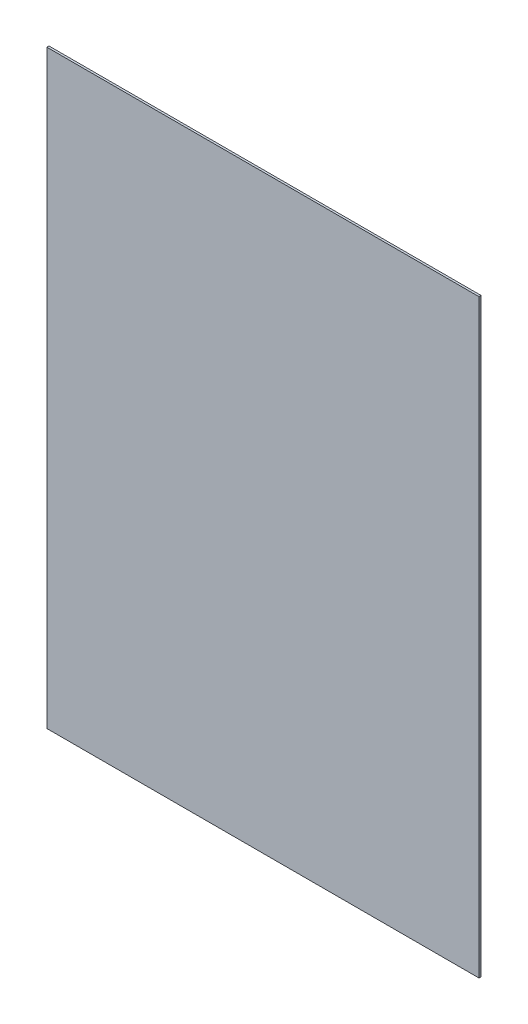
ISO-10303-21;
HEADER;
FILE_DESCRIPTION(('STEP AP214'),'2;1');
FILE_NAME('part.step','',(''),(''),'','','');
FILE_SCHEMA(('AUTOMOTIVE_DESIGN { 1 0 10303 214 1 1 1 1 }'));
ENDSEC;
DATA;
#1=APPLICATION_CONTEXT('core data for automotive mechanical design processes');
#2=APPLICATION_PROTOCOL_DEFINITION('international standard','automotive_design',2000,#1);
#3=PRODUCT_CONTEXT('',#1,'mechanical');
#4=PRODUCT('Part','Part','',(#3));
#5=PRODUCT_RELATED_PRODUCT_CATEGORY('part','',(#4));
#6=PRODUCT_DEFINITION_FORMATION('','',#4);
#7=PRODUCT_DEFINITION_CONTEXT('part definition',#1,'design');
#8=PRODUCT_DEFINITION('design','',#6,#7);
#9=PRODUCT_DEFINITION_SHAPE('','',#8);
#10=(LENGTH_UNIT() NAMED_UNIT(*) SI_UNIT(.MILLI.,.METRE.));
#11=(NAMED_UNIT(*) PLANE_ANGLE_UNIT() SI_UNIT($,.RADIAN.));
#12=(NAMED_UNIT(*) SI_UNIT($,.STERADIAN.) SOLID_ANGLE_UNIT());
#13=UNCERTAINTY_MEASURE_WITH_UNIT(LENGTH_MEASURE(1.E-05),#10,'distance_accuracy_value','');
#14=(GEOMETRIC_REPRESENTATION_CONTEXT(3) GLOBAL_UNCERTAINTY_ASSIGNED_CONTEXT((#13)) GLOBAL_UNIT_ASSIGNED_CONTEXT((#10,
#11,#12)) REPRESENTATION_CONTEXT('',''));
#15=CARTESIAN_POINT('',(0.,0.,0.));
#16=DIRECTION('',(0.,0.,1.));
#17=DIRECTION('',(1.,0.,0.));
#18=AXIS2_PLACEMENT_3D('',#15,#16,#17);
#19=CARTESIAN_POINT('',(410.,-560.,4.));
#20=DIRECTION('',(-1.,0.,0.));
#21=DIRECTION('',(0.,0.,1.));
#22=AXIS2_PLACEMENT_3D('',#19,#20,#21);
#23=PLANE('',#22);
#24=DIRECTION('',(0.,1.,0.));
#25=VECTOR('',#24,1.);
#26=CARTESIAN_POINT('',(410.,-560.,0.));
#27=LINE('',#26,#25);
#28=CARTESIAN_POINT('',(410.,-560.,0.));
#29=VERTEX_POINT('',#28);
#30=CARTESIAN_POINT('',(410.,560.,0.));
#31=VERTEX_POINT('',#30);
#32=EDGE_CURVE('E100',#29,#31,#27,.T.);
#33=ORIENTED_EDGE('',*,*,#32,.T.);
#34=DIRECTION('',(0.,0.,-1.));
#35=VECTOR('',#34,1.);
#36=CARTESIAN_POINT('',(410.,560.,4.));
#37=LINE('',#36,#35);
#38=CARTESIAN_POINT('',(410.,560.,4.));
#39=VERTEX_POINT('',#38);
#40=EDGE_CURVE('E11',#39,#31,#37,.T.);
#41=ORIENTED_EDGE('',*,*,#40,.F.);
#42=DIRECTION('',(0.,1.,0.));
#43=VECTOR('',#42,1.);
#44=CARTESIAN_POINT('',(410.,-560.,4.));
#45=LINE('',#44,#43);
#46=CARTESIAN_POINT('',(410.,-560.,4.));
#47=VERTEX_POINT('',#46);
#48=EDGE_CURVE('E88',#47,#39,#45,.T.);
#49=ORIENTED_EDGE('',*,*,#48,.F.);
#50=DIRECTION('',(0.,0.,-1.));
#51=VECTOR('',#50,1.);
#52=CARTESIAN_POINT('',(410.,-560.,4.));
#53=LINE('',#52,#51);
#54=EDGE_CURVE('E96',#47,#29,#53,.T.);
#55=ORIENTED_EDGE('',*,*,#54,.T.);
#56=EDGE_LOOP('',(#33,#41,#49,#55));
#57=FACE_BOUND('',#56,.T.);
#58=ADVANCED_FACE('F37',(#57),#23,.F.);
#59=CARTESIAN_POINT('',(-410.,560.,4.));
#60=DIRECTION('',(0.,-1.,0.));
#61=DIRECTION('',(0.,0.,-1.));
#62=AXIS2_PLACEMENT_3D('',#59,#60,#61);
#63=PLANE('',#62);
#64=DIRECTION('',(-1.,0.,0.));
#65=VECTOR('',#64,1.);
#66=CARTESIAN_POINT('',(-410.,560.,0.));
#67=LINE('',#66,#65);
#68=CARTESIAN_POINT('',(-410.,560.,0.));
#69=VERTEX_POINT('',#68);
#70=EDGE_CURVE('E92',#31,#69,#67,.T.);
#71=ORIENTED_EDGE('',*,*,#70,.T.);
#72=DIRECTION('',(0.,0.,-1.));
#73=VECTOR('',#72,1.);
#74=CARTESIAN_POINT('',(-410.,560.,4.));
#75=LINE('',#74,#73);
#76=CARTESIAN_POINT('',(-410.,560.,4.));
#77=VERTEX_POINT('',#76);
#78=EDGE_CURVE('E45',#77,#69,#75,.T.);
#79=ORIENTED_EDGE('',*,*,#78,.F.);
#80=DIRECTION('',(-1.,0.,0.));
#81=VECTOR('',#80,1.);
#82=CARTESIAN_POINT('',(-410.,560.,4.));
#83=LINE('',#82,#81);
#84=EDGE_CURVE('E83',#39,#77,#83,.T.);
#85=ORIENTED_EDGE('',*,*,#84,.F.);
#86=ORIENTED_EDGE('',*,*,#40,.T.);
#87=EDGE_LOOP('',(#71,#79,#85,#86));
#88=FACE_BOUND('',#87,.T.);
#89=ADVANCED_FACE('F91',(#88),#63,.F.);
#90=CARTESIAN_POINT('',(-410.,-560.,4.));
#91=DIRECTION('',(1.,0.,0.));
#92=DIRECTION('',(0.,0.,-1.));
#93=AXIS2_PLACEMENT_3D('',#90,#91,#92);
#94=PLANE('',#93);
#95=DIRECTION('',(0.,-1.,0.));
#96=VECTOR('',#95,1.);
#97=CARTESIAN_POINT('',(-410.,-560.,0.));
#98=LINE('',#97,#96);
#99=CARTESIAN_POINT('',(-410.,-560.,0.));
#100=VERTEX_POINT('',#99);
#101=EDGE_CURVE('E70',#69,#100,#98,.T.);
#102=ORIENTED_EDGE('',*,*,#101,.T.);
#103=DIRECTION('',(0.,0.,-1.));
#104=VECTOR('',#103,1.);
#105=CARTESIAN_POINT('',(-410.,-560.,4.));
#106=LINE('',#105,#104);
#107=CARTESIAN_POINT('',(-410.,-560.,4.));
#108=VERTEX_POINT('',#107);
#109=EDGE_CURVE('E93',#108,#100,#106,.T.);
#110=ORIENTED_EDGE('',*,*,#109,.F.);
#111=DIRECTION('',(0.,-1.,0.));
#112=VECTOR('',#111,1.);
#113=CARTESIAN_POINT('',(-410.,-560.,4.));
#114=LINE('',#113,#112);
#115=EDGE_CURVE('E86',#77,#108,#114,.T.);
#116=ORIENTED_EDGE('',*,*,#115,.F.);
#117=ORIENTED_EDGE('',*,*,#78,.T.);
#118=EDGE_LOOP('',(#102,#110,#116,#117));
#119=FACE_BOUND('',#118,.T.);
#120=ADVANCED_FACE('F94',(#119),#94,.F.);
#121=CARTESIAN_POINT('',(-410.,-560.,4.));
#122=DIRECTION('',(0.,1.,0.));
#123=DIRECTION('',(0.,0.,1.));
#124=AXIS2_PLACEMENT_3D('',#121,#122,#123);
#125=PLANE('',#124);
#126=DIRECTION('',(1.,0.,0.));
#127=VECTOR('',#126,1.);
#128=CARTESIAN_POINT('',(-410.,-560.,0.));
#129=LINE('',#128,#127);
#130=EDGE_CURVE('E76',#100,#29,#129,.T.);
#131=ORIENTED_EDGE('',*,*,#130,.T.);
#132=ORIENTED_EDGE('',*,*,#54,.F.);
#133=DIRECTION('',(1.,0.,0.));
#134=VECTOR('',#133,1.);
#135=CARTESIAN_POINT('',(-410.,-560.,4.));
#136=LINE('',#135,#134);
#137=EDGE_CURVE('E53',#108,#47,#136,.T.);
#138=ORIENTED_EDGE('',*,*,#137,.F.);
#139=ORIENTED_EDGE('',*,*,#109,.T.);
#140=EDGE_LOOP('',(#131,#132,#138,#139));
#141=FACE_BOUND('',#140,.T.);
#142=ADVANCED_FACE('F107',(#141),#125,.F.);
#143=CARTESIAN_POINT('',(0.,0.,4.));
#144=DIRECTION('',(0.,0.,-1.));
#145=DIRECTION('',(-1.,0.,0.));
#146=AXIS2_PLACEMENT_3D('',#143,#144,#145);
#147=PLANE('',#146);
#148=ORIENTED_EDGE('',*,*,#48,.T.);
#149=ORIENTED_EDGE('',*,*,#84,.T.);
#150=ORIENTED_EDGE('',*,*,#115,.T.);
#151=ORIENTED_EDGE('',*,*,#137,.T.);
#152=EDGE_LOOP('',(#148,#149,#150,#151));
#153=FACE_BOUND('',#152,.T.);
#154=ADVANCED_FACE('F84',(#153),#147,.F.);
#155=CARTESIAN_POINT('',(0.,0.,0.));
#156=DIRECTION('',(0.,0.,-1.));
#157=DIRECTION('',(-1.,0.,0.));
#158=AXIS2_PLACEMENT_3D('',#155,#156,#157);
#159=PLANE('',#158);
#160=ORIENTED_EDGE('',*,*,#32,.F.);
#161=ORIENTED_EDGE('',*,*,#130,.F.);
#162=ORIENTED_EDGE('',*,*,#101,.F.);
#163=ORIENTED_EDGE('',*,*,#70,.F.);
#164=EDGE_LOOP('',(#160,#161,#162,#163));
#165=FACE_BOUND('',#164,.T.);
#166=ADVANCED_FACE('F110',(#165),#159,.T.);
#167=CLOSED_SHELL('',(#58,#89,#120,#142,#154,#166));
#168=MANIFOLD_SOLID_BREP('B2',#167);
#169=ADVANCED_BREP_SHAPE_REPRESENTATION('',(#18,#168),#14);
#170=SHAPE_DEFINITION_REPRESENTATION(#9,#169);
ENDSEC;
END-ISO-10303-21;
